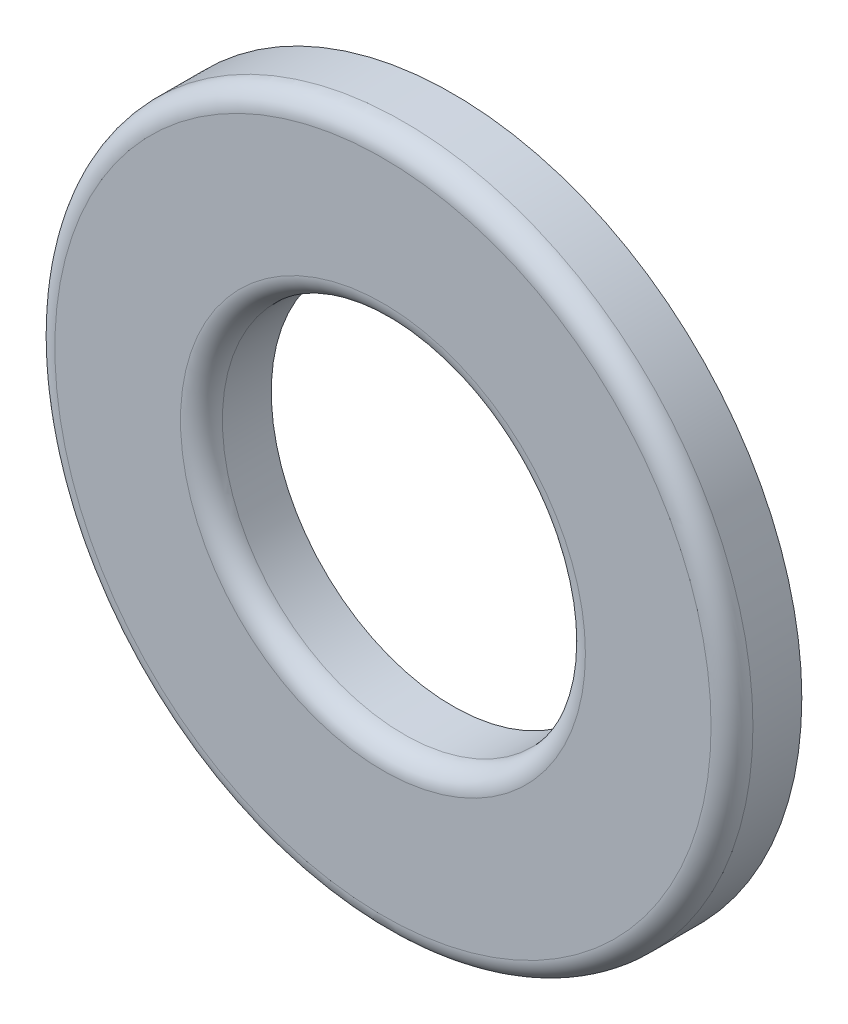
ISO-10303-21;
HEADER;
FILE_DESCRIPTION(('STEP AP214'),'2;1');
FILE_NAME('part.step','',(''),(''),'','','');
FILE_SCHEMA(('AUTOMOTIVE_DESIGN { 1 0 10303 214 1 1 1 1 }'));
ENDSEC;
DATA;
#1=APPLICATION_CONTEXT('core data for automotive mechanical design processes');
#2=APPLICATION_PROTOCOL_DEFINITION('international standard','automotive_design',2000,#1);
#3=PRODUCT_CONTEXT('',#1,'mechanical');
#4=PRODUCT('Part','Part','',(#3));
#5=PRODUCT_RELATED_PRODUCT_CATEGORY('part','',(#4));
#6=PRODUCT_DEFINITION_FORMATION('','',#4);
#7=PRODUCT_DEFINITION_CONTEXT('part definition',#1,'design');
#8=PRODUCT_DEFINITION('design','',#6,#7);
#9=PRODUCT_DEFINITION_SHAPE('','',#8);
#10=(LENGTH_UNIT() NAMED_UNIT(*) SI_UNIT(.MILLI.,.METRE.));
#11=(NAMED_UNIT(*) PLANE_ANGLE_UNIT() SI_UNIT($,.RADIAN.));
#12=(NAMED_UNIT(*) SI_UNIT($,.STERADIAN.) SOLID_ANGLE_UNIT());
#13=UNCERTAINTY_MEASURE_WITH_UNIT(LENGTH_MEASURE(1.E-05),#10,'distance_accuracy_value','');
#14=(GEOMETRIC_REPRESENTATION_CONTEXT(3) GLOBAL_UNCERTAINTY_ASSIGNED_CONTEXT((#13)) GLOBAL_UNIT_ASSIGNED_CONTEXT((#10,
#11,#12)) REPRESENTATION_CONTEXT('',''));
#15=CARTESIAN_POINT('',(0.,0.,0.));
#16=DIRECTION('',(0.,0.,1.));
#17=DIRECTION('',(1.,0.,0.));
#18=AXIS2_PLACEMENT_3D('',#15,#16,#17);
#19=CARTESIAN_POINT('',(0.,0.,1.00000000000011));
#20=DIRECTION('',(0.,0.,1.));
#21=DIRECTION('',(1.,0.,0.));
#22=AXIS2_PLACEMENT_3D('',#19,#20,#21);
#23=PLANE('',#22);
#24=CARTESIAN_POINT('',(0.,0.,1.00000000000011));
#25=DIRECTION('',(0.,0.,1.));
#26=DIRECTION('',(1.,0.,0.));
#27=AXIS2_PLACEMENT_3D('',#24,#25,#26);
#28=CIRCLE('',#27,4.7);
#29=CARTESIAN_POINT('',(4.70000000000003,0.,1.0000000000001));
#30=VERTEX_POINT('',#29);
#31=EDGE_CURVE('E37',#30,#30,#28,.T.);
#32=ORIENTED_EDGE('',*,*,#31,.T.);
#33=EDGE_LOOP('',(#32));
#34=FACE_BOUND('',#33,.T.);
#35=CARTESIAN_POINT('',(0.,0.,1.00000000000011));
#36=DIRECTION('',(0.,0.,1.));
#37=DIRECTION('',(1.,0.,0.));
#38=AXIS2_PLACEMENT_3D('',#35,#36,#37);
#39=CIRCLE('',#38,2.9);
#40=CARTESIAN_POINT('',(2.90000000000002,0.,1.00000000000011));
#41=VERTEX_POINT('',#40);
#42=EDGE_CURVE('E41',#41,#41,#39,.F.);
#43=ORIENTED_EDGE('',*,*,#42,.T.);
#44=EDGE_LOOP('',(#43));
#45=FACE_BOUND('',#44,.T.);
#46=ADVANCED_FACE('F26',(#34,#45),#23,.T.);
#47=CARTESIAN_POINT('',(0.,0.,1.07552855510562E-13));
#48=DIRECTION('',(0.,0.,1.));
#49=DIRECTION('',(1.,0.,0.));
#50=AXIS2_PLACEMENT_3D('',#47,#48,#49);
#51=PLANE('',#50);
#52=CARTESIAN_POINT('',(0.,0.,1.07552855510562E-13));
#53=DIRECTION('',(0.,0.,1.));
#54=DIRECTION('',(1.,0.,0.));
#55=AXIS2_PLACEMENT_3D('',#52,#53,#54);
#56=CIRCLE('',#55,5.);
#57=CARTESIAN_POINT('',(5.00000000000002,0.,1.01663328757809E-13));
#58=VERTEX_POINT('',#57);
#59=EDGE_CURVE('E46',#58,#58,#56,.T.);
#60=ORIENTED_EDGE('',*,*,#59,.F.);
#61=EDGE_LOOP('',(#60));
#62=FACE_BOUND('',#61,.T.);
#63=CARTESIAN_POINT('',(0.,0.,1.07552855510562E-13));
#64=DIRECTION('',(0.,0.,1.));
#65=DIRECTION('',(1.,0.,0.));
#66=AXIS2_PLACEMENT_3D('',#63,#64,#65);
#67=CIRCLE('',#66,2.6);
#68=CARTESIAN_POINT('',(2.60000000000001,0.,1.0449030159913E-13));
#69=VERTEX_POINT('',#68);
#70=EDGE_CURVE('E49',#69,#69,#67,.T.);
#71=ORIENTED_EDGE('',*,*,#70,.T.);
#72=EDGE_LOOP('',(#71));
#73=FACE_BOUND('',#72,.T.);
#74=ADVANCED_FACE('F53',(#62,#73),#51,.F.);
#75=CARTESIAN_POINT('',(0.,0.,1.00000000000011));
#76=DIRECTION('',(0.,0.,-1.));
#77=DIRECTION('',(-1.,0.,0.));
#78=AXIS2_PLACEMENT_3D('',#75,#76,#77);
#79=CYLINDRICAL_SURFACE('',#78,5.);
#80=CARTESIAN_POINT('',(0.,0.,0.700000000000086));
#81=DIRECTION('',(0.,0.,1.));
#82=DIRECTION('',(1.,0.,0.));
#83=AXIS2_PLACEMENT_3D('',#80,#81,#82);
#84=CIRCLE('',#83,5.);
#85=CARTESIAN_POINT('',(5.00000000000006,0.,0.70000000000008));
#86=VERTEX_POINT('',#85);
#87=EDGE_CURVE('E33',#86,#86,#84,.F.);
#88=ORIENTED_EDGE('',*,*,#87,.T.);
#89=EDGE_LOOP('',(#88));
#90=FACE_BOUND('',#89,.T.);
#91=ORIENTED_EDGE('',*,*,#59,.T.);
#92=EDGE_LOOP('',(#91));
#93=FACE_BOUND('',#92,.T.);
#94=ADVANCED_FACE('F28',(#90,#93),#79,.T.);
#95=CARTESIAN_POINT('',(0.,0.,1.00000000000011));
#96=DIRECTION('',(0.,0.,-1.));
#97=DIRECTION('',(-1.,0.,0.));
#98=AXIS2_PLACEMENT_3D('',#95,#96,#97);
#99=CYLINDRICAL_SURFACE('',#98,2.6);
#100=CARTESIAN_POINT('',(0.,0.,0.700000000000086));
#101=DIRECTION('',(0.,0.,1.));
#102=DIRECTION('',(1.,0.,0.));
#103=AXIS2_PLACEMENT_3D('',#100,#101,#102);
#104=CIRCLE('',#103,2.6);
#105=CARTESIAN_POINT('',(2.60000000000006,0.,0.700000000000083));
#106=VERTEX_POINT('',#105);
#107=EDGE_CURVE('E10',#106,#106,#104,.T.);
#108=ORIENTED_EDGE('',*,*,#107,.T.);
#109=EDGE_LOOP('',(#108));
#110=FACE_BOUND('',#109,.T.);
#111=ORIENTED_EDGE('',*,*,#70,.F.);
#112=EDGE_LOOP('',(#111));
#113=FACE_BOUND('',#112,.T.);
#114=ADVANCED_FACE('F55',(#110,#113),#99,.F.);
#115=CARTESIAN_POINT('',(0.,0.,0.700000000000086));
#116=DIRECTION('',(0.,0.,1.));
#117=DIRECTION('',(1.,0.,0.));
#118=AXIS2_PLACEMENT_3D('',#115,#116,#117);
#119=TOROIDAL_SURFACE('',#118,4.7,0.3);
#120=ORIENTED_EDGE('',*,*,#87,.F.);
#121=EDGE_LOOP('',(#120));
#122=FACE_BOUND('',#121,.T.);
#123=ORIENTED_EDGE('',*,*,#31,.F.);
#124=EDGE_LOOP('',(#123));
#125=FACE_BOUND('',#124,.T.);
#126=ADVANCED_FACE('F57',(#122,#125),#119,.T.);
#127=CARTESIAN_POINT('',(0.,0.,0.700000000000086));
#128=DIRECTION('',(0.,0.,1.));
#129=DIRECTION('',(1.,0.,0.));
#130=AXIS2_PLACEMENT_3D('',#127,#128,#129);
#131=TOROIDAL_SURFACE('',#130,2.9,0.3);
#132=ORIENTED_EDGE('',*,*,#42,.F.);
#133=EDGE_LOOP('',(#132));
#134=FACE_BOUND('',#133,.T.);
#135=ORIENTED_EDGE('',*,*,#107,.F.);
#136=EDGE_LOOP('',(#135));
#137=FACE_BOUND('',#136,.T.);
#138=ADVANCED_FACE('F63',(#134,#137),#131,.T.);
#139=CLOSED_SHELL('',(#46,#74,#94,#114,#126,#138));
#140=MANIFOLD_SOLID_BREP('B2',#139);
#141=ADVANCED_BREP_SHAPE_REPRESENTATION('',(#18,#140),#14);
#142=SHAPE_DEFINITION_REPRESENTATION(#9,#141);
ENDSEC;
END-ISO-10303-21;
